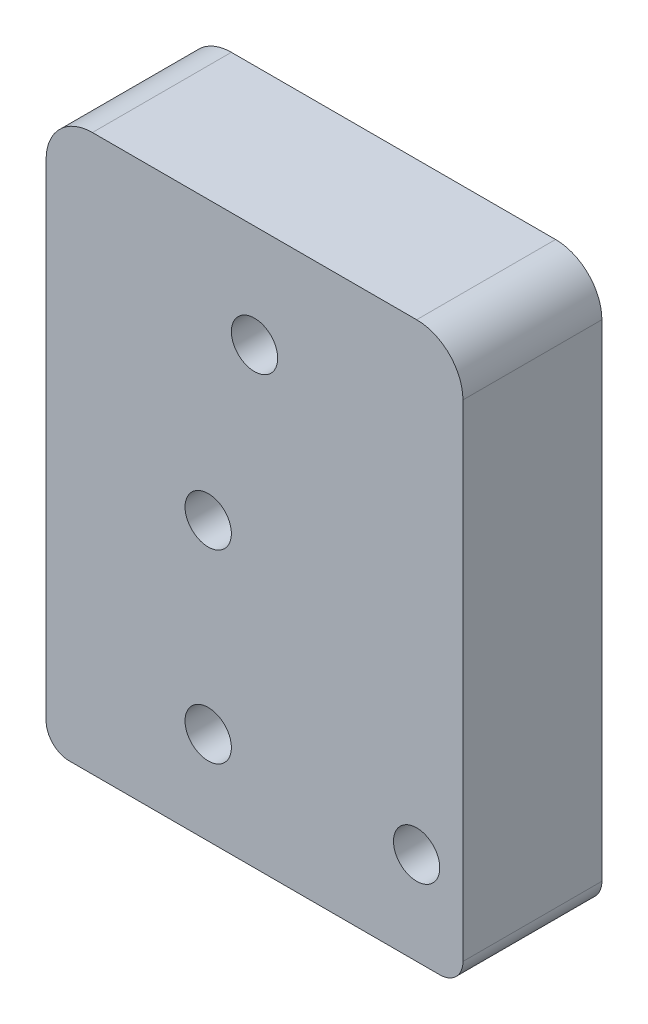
from build123d import *

# Parameters (mm, degrees)
SKETCH1_R           = 3.175
BOSS_EXTRUDE1_DEPTH = 19.05
CUT_EXTRUDE2_DEPTH  = 9.525


with BuildPart() as part:
    # Sketch1 → Boss-Extrude1 (new body)
    with BuildSketch(Plane.XY):
        with BuildLine():
            Line((3.175, 0), (53.975, 0))
            ThreePointArc((53.975, 0), (56.22006403, 0.92993597), (57.15, 3.175))
            Line((57.15, 3.175), (57.15, 69.85))
            ThreePointArc((57.15, 69.85), (55.290128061, 74.340128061), (50.8, 76.2))
            Line((50.8, 76.2), (6.35, 76.2))
            ThreePointArc((6.35, 76.2), (1.859871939, 74.340128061), (0, 69.85))
            Line((0, 69.85), (0, 3.175))
            ThreePointArc((0, 3.175), (0.92993597, 0.92993597), (3.175, 0))
        make_face()
        with Locations(Location((22.225, 12.7, 0), (0, 0, 180))):
            Circle(SKETCH1_R, mode=Mode.SUBTRACT)
        with Locations(Location((22.225, 38.1, 0), (0, 0, 180))):
            Circle(SKETCH1_R, mode=Mode.SUBTRACT)
        with Locations(Location((50.8, 12.7, 0), (0, 0, 180))):
            Circle(SKETCH1_R, mode=Mode.SUBTRACT)
        with Locations(Location((28.575, 62.096854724, 0), (0, 0, 180))):
            Circle(SKETCH1_R, mode=Mode.SUBTRACT)
    extrude(amount=BOSS_EXTRUDE1_DEPTH)

    # Sketch3 → Cut-Extrude2 (cut)
    with BuildSketch(Plane(origin=(0, 0, 0), x_dir=(-1, 0, 0), z_dir=(0, 0, -1))):
        Polygon((-22.225, 49.396854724), (0, 49.396854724), (0, 0), (-44.45, 0), (-44.45, 49.396854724), align=None)
    extrude(amount=-CUT_EXTRUDE2_DEPTH, mode=Mode.SUBTRACT)


solid = part.part
